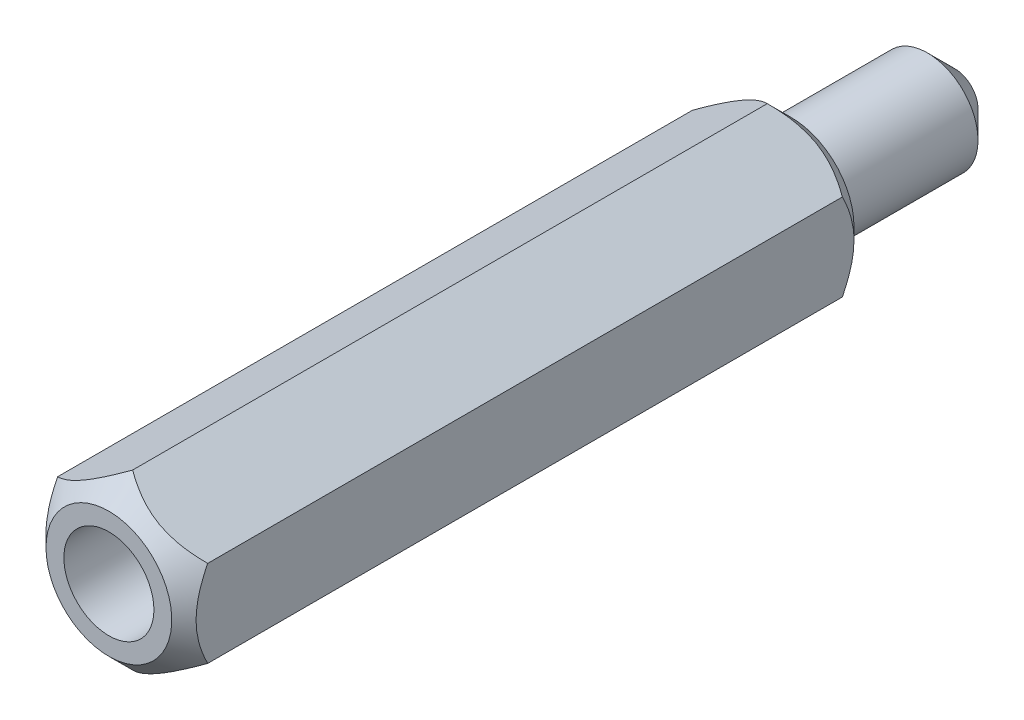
ISO-10303-21;
HEADER;
FILE_DESCRIPTION(('STEP AP214'),'2;1');
FILE_NAME('part.step','',(''),(''),'','','');
FILE_SCHEMA(('AUTOMOTIVE_DESIGN { 1 0 10303 214 1 1 1 1 }'));
ENDSEC;
DATA;
#1=APPLICATION_CONTEXT('core data for automotive mechanical design processes');
#2=APPLICATION_PROTOCOL_DEFINITION('international standard','automotive_design',2000,#1);
#3=PRODUCT_CONTEXT('',#1,'mechanical');
#4=PRODUCT('Part','Part','',(#3));
#5=PRODUCT_RELATED_PRODUCT_CATEGORY('part','',(#4));
#6=PRODUCT_DEFINITION_FORMATION('','',#4);
#7=PRODUCT_DEFINITION_CONTEXT('part definition',#1,'design');
#8=PRODUCT_DEFINITION('design','',#6,#7);
#9=PRODUCT_DEFINITION_SHAPE('','',#8);
#10=(LENGTH_UNIT() NAMED_UNIT(*) SI_UNIT(.MILLI.,.METRE.));
#11=(NAMED_UNIT(*) PLANE_ANGLE_UNIT() SI_UNIT($,.RADIAN.));
#12=(NAMED_UNIT(*) SI_UNIT($,.STERADIAN.) SOLID_ANGLE_UNIT());
#13=UNCERTAINTY_MEASURE_WITH_UNIT(LENGTH_MEASURE(1.E-05),#10,'distance_accuracy_value','');
#14=(GEOMETRIC_REPRESENTATION_CONTEXT(3) GLOBAL_UNCERTAINTY_ASSIGNED_CONTEXT((#13)) GLOBAL_UNIT_ASSIGNED_CONTEXT((#10,
#11,#12)) REPRESENTATION_CONTEXT('',''));
#15=CARTESIAN_POINT('',(0.,0.,0.));
#16=DIRECTION('',(0.,0.,1.));
#17=DIRECTION('',(1.,0.,0.));
#18=AXIS2_PLACEMENT_3D('',#15,#16,#17);
#19=CARTESIAN_POINT('',(0.,0.,-18.5));
#20=DIRECTION('',(0.,0.,-1.));
#21=DIRECTION('',(-1.,0.,0.));
#22=AXIS2_PLACEMENT_3D('',#19,#20,#21);
#23=PLANE('',#22);
#24=CARTESIAN_POINT('',(0.,0.,-18.5000000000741));
#25=DIRECTION('',(0.,0.,1.));
#26=DIRECTION('',(1.,0.,0.));
#27=AXIS2_PLACEMENT_3D('',#24,#25,#26);
#28=CIRCLE('',#27,0.849999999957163);
#29=CARTESIAN_POINT('',(0.849999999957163,0.,-18.5000000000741));
#30=VERTEX_POINT('',#29);
#31=EDGE_CURVE('E17',#30,#30,#28,.T.);
#32=ORIENTED_EDGE('',*,*,#31,.F.);
#33=EDGE_LOOP('',(#32));
#34=FACE_BOUND('',#33,.T.);
#35=ADVANCED_FACE('F14',(#34),#23,.T.);
#36=CARTESIAN_POINT('',(0.,0.,-17.5000000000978));
#37=DIRECTION('',(0.,0.,1.));
#38=DIRECTION('',(1.,0.,0.));
#39=AXIS2_PLACEMENT_3D('',#36,#37,#38);
#40=CONICAL_SURFACE('',#39,1.84999999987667,0.785398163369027);
#41=ORIENTED_EDGE('',*,*,#31,.T.);
#42=EDGE_LOOP('',(#41));
#43=FACE_BOUND('',#42,.T.);
#44=CARTESIAN_POINT('',(0.,0.,-17.5));
#45=DIRECTION('',(0.,0.,1.));
#46=DIRECTION('',(1.,0.,0.));
#47=AXIS2_PLACEMENT_3D('',#44,#45,#46);
#48=CIRCLE('',#47,1.85);
#49=CARTESIAN_POINT('',(1.85,0.,-17.5));
#50=VERTEX_POINT('',#49);
#51=EDGE_CURVE('E107',#50,#50,#48,.T.);
#52=ORIENTED_EDGE('',*,*,#51,.F.);
#53=EDGE_LOOP('',(#52));
#54=FACE_BOUND('',#53,.T.);
#55=ADVANCED_FACE('F208',(#43,#54),#40,.T.);
#56=CARTESIAN_POINT('',(0.,0.,0.400000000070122));
#57=DIRECTION('',(0.,0.,1.));
#58=DIRECTION('',(0.,-1.,0.));
#59=AXIS2_PLACEMENT_3D('',#56,#57,#58);
#60=CONICAL_SURFACE('',#59,1.64999999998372,1.02974425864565);
#61=CARTESIAN_POINT('',(5.6843418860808E-11,0.,-0.59142002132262));
#62=VERTEX_POINT('',#61);
#63=VERTEX_LOOP('',#62);
#64=FACE_BOUND('',#63,.T.);
#65=CARTESIAN_POINT('',(0.,0.,0.400000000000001));
#66=DIRECTION('',(0.,0.,1.));
#67=DIRECTION('',(1.,0.,0.));
#68=AXIS2_PLACEMENT_3D('',#65,#66,#67);
#69=CIRCLE('',#68,1.64999999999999);
#70=CARTESIAN_POINT('',(1.64999999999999,0.,0.400000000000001));
#71=VERTEX_POINT('',#70);
#72=EDGE_CURVE('E89',#71,#71,#69,.T.);
#73=ORIENTED_EDGE('',*,*,#72,.T.);
#74=EDGE_LOOP('',(#73));
#75=FACE_BOUND('',#74,.T.);
#76=ADVANCED_FACE('F205',(#64,#75),#60,.F.);
#77=CARTESIAN_POINT('',(0.,0.,-18.5));
#78=DIRECTION('',(0.,0.,1.));
#79=DIRECTION('',(1.,0.,0.));
#80=AXIS2_PLACEMENT_3D('',#77,#78,#79);
#81=CYLINDRICAL_SURFACE('',#80,1.85);
#82=ORIENTED_EDGE('',*,*,#51,.T.);
#83=EDGE_LOOP('',(#82));
#84=FACE_BOUND('',#83,.T.);
#85=CARTESIAN_POINT('',(0.,0.,-12.5));
#86=DIRECTION('',(0.,0.,1.));
#87=DIRECTION('',(1.,0.,0.));
#88=AXIS2_PLACEMENT_3D('',#85,#86,#87);
#89=CIRCLE('',#88,1.85);
#90=CARTESIAN_POINT('',(1.85,0.,-12.5));
#91=VERTEX_POINT('',#90);
#92=EDGE_CURVE('E243',#91,#91,#89,.F.);
#93=ORIENTED_EDGE('',*,*,#92,.T.);
#94=EDGE_LOOP('',(#93));
#95=FACE_BOUND('',#94,.T.);
#96=ADVANCED_FACE('F201',(#84,#95),#81,.T.);
#97=CARTESIAN_POINT('',(0.,0.,12.5));
#98=DIRECTION('',(0.,0.,1.));
#99=DIRECTION('',(1.,0.,0.));
#100=AXIS2_PLACEMENT_3D('',#97,#98,#99);
#101=CYLINDRICAL_SURFACE('',#100,1.64999999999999);
#102=CARTESIAN_POINT('',(0.,0.,12.5));
#103=DIRECTION('',(0.,0.,1.));
#104=DIRECTION('',(1.,0.,0.));
#105=AXIS2_PLACEMENT_3D('',#102,#103,#104);
#106=CIRCLE('',#105,1.64999999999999);
#107=CARTESIAN_POINT('',(1.64999999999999,0.,12.5));
#108=VERTEX_POINT('',#107);
#109=EDGE_CURVE('E92',#108,#108,#106,.F.);
#110=ORIENTED_EDGE('',*,*,#109,.F.);
#111=EDGE_LOOP('',(#110));
#112=FACE_BOUND('',#111,.T.);
#113=ORIENTED_EDGE('',*,*,#72,.F.);
#114=EDGE_LOOP('',(#113));
#115=FACE_BOUND('',#114,.T.);
#116=ADVANCED_FACE('F197',(#112,#115),#101,.F.);
#117=CARTESIAN_POINT('',(2.74999999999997,1.58771324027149,12.5));
#118=DIRECTION('',(-0.5,-0.866025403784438,0.));
#119=DIRECTION('',(0.866025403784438,-0.5,0.));
#120=AXIS2_PLACEMENT_3D('',#117,#118,#119);
#121=PLANE('',#120);
#122=CARTESIAN_POINT('',(2.7500000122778,1.58771323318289,11.6294013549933));
#123=CARTESIAN_POINT('',(2.65548116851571,1.64228371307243,11.6839194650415));
#124=CARTESIAN_POINT('',(2.55938196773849,1.69776661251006,11.7352351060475));
#125=CARTESIAN_POINT('',(2.36342583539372,1.81090193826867,11.829191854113));
#126=CARTESIAN_POINT('',(2.26355027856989,1.86856511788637,11.8717807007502));
#127=CARTESIAN_POINT('',(2.06215611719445,1.9848400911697,11.9447356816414));
#128=CARTESIAN_POINT('',(1.96068877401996,2.04342228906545,11.9752851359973));
#129=CARTESIAN_POINT('',(1.75552090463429,2.16187601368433,12.0223523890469));
#130=CARTESIAN_POINT('',(1.65182664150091,2.2217439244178,12.0389053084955));
#131=CARTESIAN_POINT('',(1.47310480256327,2.32492902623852,12.0538407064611));
#132=CARTESIAN_POINT('',(1.39830795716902,2.36811300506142,12.0560509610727));
#133=CARTESIAN_POINT('',(1.24883664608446,2.45441030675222,12.0523225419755));
#134=CARTESIAN_POINT('',(1.17416223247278,2.4975235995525,12.0463810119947));
#135=CARTESIAN_POINT('',(1.02551863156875,2.58334302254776,12.0266871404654));
#136=CARTESIAN_POINT('',(0.951550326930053,2.62604864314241,12.0129260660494));
#137=CARTESIAN_POINT('',(0.804892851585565,2.71072137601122,11.9783484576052));
#138=CARTESIAN_POINT('',(0.732203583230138,2.75268854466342,11.9575324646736));
#139=CARTESIAN_POINT('',(0.546058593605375,2.86015940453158,11.895750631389));
#140=CARTESIAN_POINT('',(0.433755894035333,2.92499739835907,11.850132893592));
#141=CARTESIAN_POINT('',(0.268623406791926,3.020336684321,11.7731261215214));
#142=CARTESIAN_POINT('',(0.214204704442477,3.0517553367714,11.7460698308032));
#143=CARTESIAN_POINT('',(0.106374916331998,3.11401089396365,11.6894912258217));
#144=CARTESIAN_POINT('',(0.0529632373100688,3.14484814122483,11.6599704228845));
#145=CARTESIAN_POINT('',(-2.68740248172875E-11,3.17542648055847,11.6294013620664));
#146=B_SPLINE_CURVE_WITH_KNOTS('',3,(#122,#123,#124,#125,#126,#127,#128,#129,#130,#131,#132,
#133,#134,#135,#136,#137,#138,#139,#140,#141,#142,#143,#144,#145),.UNSPECIFIED.,.F.,.F.,(4,2,2,
2,2,2,2,2,2,2,2,4),(0.,0.366253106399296,0.734639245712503,1.09717665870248,1.45880165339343,
1.71762351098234,1.97653607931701,2.23573837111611,2.49492078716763,2.90645502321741,
3.11166392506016,3.31674789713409),.UNSPECIFIED.);
#147=CARTESIAN_POINT('',(2.75000000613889,1.58771320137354,11.6294013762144));
#148=VERTEX_POINT('',#147);
#149=CARTESIAN_POINT('',(0.,3.17542648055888,11.629401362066));
#150=VERTEX_POINT('',#149);
#151=EDGE_CURVE('E88',#148,#150,#146,.T.);
#152=ORIENTED_EDGE('',*,*,#151,.F.);
#153=DIRECTION('',(0.,0.,1.));
#154=VECTOR('',#153,1.);
#155=CARTESIAN_POINT('',(2.74999999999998,1.58771324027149,12.5));
#156=LINE('',#155,#154);
#157=CARTESIAN_POINT('',(2.75000000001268,1.58771324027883,-11.6294013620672));
#158=VERTEX_POINT('',#157);
#159=EDGE_CURVE('E70',#148,#158,#156,.F.);
#160=ORIENTED_EDGE('',*,*,#159,.T.);
#161=CARTESIAN_POINT('',(-3.06724764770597E-11,3.17542648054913,-11.6294013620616));
#162=CARTESIAN_POINT('',(0.0945188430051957,3.12085600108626,-11.6839194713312));
#163=CARTESIAN_POINT('',(0.190618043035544,3.06537310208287,-11.7352351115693));
#164=CARTESIAN_POINT('',(0.386574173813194,2.95223777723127,-11.8291918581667));
#165=CARTESIAN_POINT('',(0.486449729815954,2.89457459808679,-11.8717807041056));
#166=CARTESIAN_POINT('',(0.68784388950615,2.77829962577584,-11.9447356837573));
#167=CARTESIAN_POINT('',(0.789311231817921,2.7197174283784,-11.9752851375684));
#168=CARTESIAN_POINT('',(0.994479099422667,2.6012637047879,-12.0223523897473));
#169=CARTESIAN_POINT('',(1.09817336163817,2.54139579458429,-12.0389053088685));
#170=CARTESIAN_POINT('',(1.27689519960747,2.43821069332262,-12.053840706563));
#171=CARTESIAN_POINT('',(1.35169204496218,2.39502671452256,-12.0560509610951));
#172=CARTESIAN_POINT('',(1.50116335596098,2.30872941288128,-12.052322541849));
#173=CARTESIAN_POINT('',(1.57583776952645,2.26561612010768,-12.0463810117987));
#174=CARTESIAN_POINT('',(1.72448137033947,2.17979669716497,-12.0266871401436));
#175=CARTESIAN_POINT('',(1.7984496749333,2.13709107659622,-12.0129260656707));
#176=CARTESIAN_POINT('',(1.94510715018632,2.05241834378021,-11.9783484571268));
#177=CARTESIAN_POINT('',(2.01779641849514,2.01045117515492,-11.9575324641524));
#178=CARTESIAN_POINT('',(2.20394140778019,1.90298031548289,-11.8957506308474));
#179=CARTESIAN_POINT('',(2.31624410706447,1.8381423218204,-11.8501328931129));
#180=CARTESIAN_POINT('',(2.48137659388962,1.74280303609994,-11.7731261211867));
#181=CARTESIAN_POINT('',(2.53579529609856,1.71138438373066,-11.7460698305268));
#182=CARTESIAN_POINT('',(2.64362508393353,1.64912882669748,-11.689491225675));
#183=CARTESIAN_POINT('',(2.69703676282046,1.61829157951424,-11.6599704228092));
#184=CARTESIAN_POINT('',(2.75000000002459,1.58771324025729,-11.6294013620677));
#185=B_SPLINE_CURVE_WITH_KNOTS('',3,(#161,#162,#163,#164,#165,#166,#167,#168,#169,#170,#171,
#172,#173,#174,#175,#176,#177,#178,#179,#180,#181,#182,#183,#184),.UNSPECIFIED.,.F.,.F.,(4,2,2,
2,2,2,2,2,2,2,2,4),(0.,0.366253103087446,0.734639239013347,1.09717664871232,1.45880164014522,
1.71762349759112,1.97653606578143,2.23573835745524,2.49492077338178,2.90645500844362,
3.11166390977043,3.31674788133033),.UNSPECIFIED.);
#186=CARTESIAN_POINT('',(-1.3795895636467E-11,3.17542648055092,-11.6294013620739));
#187=VERTEX_POINT('',#186);
#188=EDGE_CURVE('E79',#187,#158,#185,.T.);
#189=ORIENTED_EDGE('',*,*,#188,.F.);
#190=DIRECTION('',(0.,0.,1.));
#191=VECTOR('',#190,1.);
#192=CARTESIAN_POINT('',(0.,3.17542648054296,12.5));
#193=LINE('',#192,#191);
#194=EDGE_CURVE('E103',#187,#150,#193,.T.);
#195=ORIENTED_EDGE('',*,*,#194,.T.);
#196=EDGE_LOOP('',(#152,#160,#189,#195));
#197=FACE_BOUND('',#196,.T.);
#198=ADVANCED_FACE('F91',(#197),#121,.F.);
#199=CARTESIAN_POINT('',(0.,0.,-12.5));
#200=DIRECTION('',(0.,0.,1.));
#201=DIRECTION('',(1.,0.,0.));
#202=AXIS2_PLACEMENT_3D('',#199,#200,#201);
#203=PLANE('',#202);
#204=ORIENTED_EDGE('',*,*,#92,.F.);
#205=EDGE_LOOP('',(#204));
#206=FACE_BOUND('',#205,.T.);
#207=CARTESIAN_POINT('',(0.,0.,-12.5000000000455));
#208=DIRECTION('',(0.,0.,1.));
#209=DIRECTION('',(1.,0.,0.));
#210=AXIS2_PLACEMENT_3D('',#207,#208,#209);
#211=CIRCLE('',#210,2.30482784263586);
#212=CARTESIAN_POINT('',(2.30482784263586,0.,-12.5000000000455));
#213=VERTEX_POINT('',#212);
#214=EDGE_CURVE('E76',#213,#213,#211,.T.);
#215=ORIENTED_EDGE('',*,*,#214,.F.);
#216=EDGE_LOOP('',(#215));
#217=FACE_BOUND('',#216,.T.);
#218=ADVANCED_FACE('F196',(#206,#217),#203,.F.);
#219=CARTESIAN_POINT('',(0.,3.17542648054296,12.5));
#220=DIRECTION('',(0.5,-0.866025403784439,0.));
#221=DIRECTION('',(0.866025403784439,0.5,0.));
#222=AXIS2_PLACEMENT_3D('',#219,#220,#221);
#223=PLANE('',#222);
#224=CARTESIAN_POINT('',(3.06443245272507E-11,3.17542648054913,11.6294013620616));
#225=CARTESIAN_POINT('',(-0.0945188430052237,3.12085600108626,11.6839194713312));
#226=CARTESIAN_POINT('',(-0.190618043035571,3.06537310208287,11.7352351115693));
#227=CARTESIAN_POINT('',(-0.386574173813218,2.95223777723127,11.8291918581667));
#228=CARTESIAN_POINT('',(-0.486449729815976,2.89457459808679,11.8717807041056));
#229=CARTESIAN_POINT('',(-0.687843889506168,2.77829962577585,11.9447356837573));
#230=CARTESIAN_POINT('',(-0.789311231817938,2.71971742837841,11.9752851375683));
#231=CARTESIAN_POINT('',(-0.994479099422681,2.60126370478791,12.0223523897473));
#232=CARTESIAN_POINT('',(-1.09817336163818,2.54139579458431,12.0389053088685));
#233=CARTESIAN_POINT('',(-1.27689519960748,2.43821069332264,12.053840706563));
#234=CARTESIAN_POINT('',(-1.35169204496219,2.39502671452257,12.0560509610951));
#235=CARTESIAN_POINT('',(-1.501163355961,2.30872941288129,12.052322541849));
#236=CARTESIAN_POINT('',(-1.57583776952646,2.26561612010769,12.0463810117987));
#237=CARTESIAN_POINT('',(-1.72448137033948,2.17979669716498,12.0266871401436));
#238=CARTESIAN_POINT('',(-1.79844967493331,2.13709107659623,12.0129260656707));
#239=CARTESIAN_POINT('',(-1.94510715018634,2.05241834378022,11.9783484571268));
#240=CARTESIAN_POINT('',(-2.01779641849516,2.01045117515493,11.9575324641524));
#241=CARTESIAN_POINT('',(-2.20394140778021,1.9029803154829,11.8957506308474));
#242=CARTESIAN_POINT('',(-2.31624410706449,1.8381423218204,11.8501328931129));
#243=CARTESIAN_POINT('',(-2.48137659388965,1.74280303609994,11.7731261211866));
#244=CARTESIAN_POINT('',(-2.53579529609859,1.71138438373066,11.7460698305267));
#245=CARTESIAN_POINT('',(-2.64362508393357,1.64912882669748,11.689491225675));
#246=CARTESIAN_POINT('',(-2.69703676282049,1.61829157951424,11.6599704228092));
#247=CARTESIAN_POINT('',(-2.75000000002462,1.58771324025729,11.6294013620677));
#248=B_SPLINE_CURVE_WITH_KNOTS('',3,(#224,#225,#226,#227,#228,#229,#230,#231,#232,#233,#234,
#235,#236,#237,#238,#239,#240,#241,#242,#243,#244,#245,#246,#247),.UNSPECIFIED.,.F.,.F.,(4,2,2,
2,2,2,2,2,2,2,2,4),(0.,0.36625310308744,0.734639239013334,1.0971766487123,1.4588016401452,
1.7176234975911,1.97653606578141,2.23573835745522,2.49492077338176,2.90645500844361,
3.11166390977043,3.31674788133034),.UNSPECIFIED.);
#249=CARTESIAN_POINT('',(-2.75000000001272,1.58771324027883,11.6294013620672));
#250=VERTEX_POINT('',#249);
#251=EDGE_CURVE('E97',#150,#250,#248,.T.);
#252=ORIENTED_EDGE('',*,*,#251,.F.);
#253=ORIENTED_EDGE('',*,*,#194,.F.);
#254=CARTESIAN_POINT('',(-2.75000001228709,1.58771323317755,-11.6294013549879));
#255=CARTESIAN_POINT('',(-2.65548116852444,1.6422837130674,-11.6839194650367));
#256=CARTESIAN_POINT('',(-2.55938196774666,1.69776661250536,-11.7352351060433));
#257=CARTESIAN_POINT('',(-2.3634258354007,1.81090193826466,-11.8291918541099));
#258=CARTESIAN_POINT('',(-2.26355027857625,1.86856511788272,-11.8717807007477));
#259=CARTESIAN_POINT('',(-2.06215611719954,1.98484009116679,-11.9447356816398));
#260=CARTESIAN_POINT('',(-1.96068877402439,2.04342228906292,-11.9752851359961));
#261=CARTESIAN_POINT('',(-1.75552090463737,2.16187601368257,-12.0223523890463));
#262=CARTESIAN_POINT('',(-1.6518266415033,2.22174392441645,-12.0389053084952));
#263=CARTESIAN_POINT('',(-1.47310480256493,2.32492902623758,-12.053840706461));
#264=CARTESIAN_POINT('',(-1.39830795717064,2.3681130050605,-12.0560509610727));
#265=CARTESIAN_POINT('',(-1.24883664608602,2.45441030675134,-12.0523225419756));
#266=CARTESIAN_POINT('',(-1.1741622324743,2.49752359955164,-12.0463810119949));
#267=CARTESIAN_POINT('',(-1.0255186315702,2.58334302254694,-12.0266871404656));
#268=CARTESIAN_POINT('',(-0.951550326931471,2.62604864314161,-12.0129260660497));
#269=CARTESIAN_POINT('',(-0.804892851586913,2.71072137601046,-11.9783484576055));
#270=CARTESIAN_POINT('',(-0.732203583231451,2.75268854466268,-11.957532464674));
#271=CARTESIAN_POINT('',(-0.546058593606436,2.86015940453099,-11.8957506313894));
#272=CARTESIAN_POINT('',(-0.433755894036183,2.92499739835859,-11.8501328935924));
#273=CARTESIAN_POINT('',(-0.268623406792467,3.02033668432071,-11.7731261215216));
#274=CARTESIAN_POINT('',(-0.214204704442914,3.05175533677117,-11.7460698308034));
#275=CARTESIAN_POINT('',(-0.106374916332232,3.11401089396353,-11.6894912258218));
#276=CARTESIAN_POINT('',(-0.0529632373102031,3.14484814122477,-11.6599704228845));
#277=CARTESIAN_POINT('',(2.68385301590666E-11,3.17542648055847,-11.6294013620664));
#278=B_SPLINE_CURVE_WITH_KNOTS('',3,(#254,#255,#256,#257,#258,#259,#260,#261,#262,#263,#264,
#265,#266,#267,#268,#269,#270,#271,#272,#273,#274,#275,#276,#277),.UNSPECIFIED.,.F.,.F.,(4,2,2,
2,2,2,2,2,2,2,2,4),(0.,0.366253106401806,0.734639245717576,1.09717665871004,1.45880165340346,
1.71762351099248,1.97653607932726,2.23573837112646,2.49492078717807,2.90645502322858,
3.11166392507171,3.31674789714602),.UNSPECIFIED.);
#279=CARTESIAN_POINT('',(-2.75000000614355,1.58771320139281,-11.6294013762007));
#280=VERTEX_POINT('',#279);
#281=EDGE_CURVE('E84',#280,#187,#278,.T.);
#282=ORIENTED_EDGE('',*,*,#281,.F.);
#283=DIRECTION('',(0.,0.,-1.));
#284=VECTOR('',#283,1.);
#285=CARTESIAN_POINT('',(-2.75000000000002,1.58771324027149,12.5));
#286=LINE('',#285,#284);
#287=EDGE_CURVE('E101',#280,#250,#286,.F.);
#288=ORIENTED_EDGE('',*,*,#287,.T.);
#289=EDGE_LOOP('',(#252,#253,#282,#288));
#290=FACE_BOUND('',#289,.T.);
#291=ADVANCED_FACE('F242',(#290),#223,.F.);
#292=CARTESIAN_POINT('',(0.,0.,12.5));
#293=DIRECTION('',(0.,0.,1.));
#294=DIRECTION('',(1.,0.,0.));
#295=AXIS2_PLACEMENT_3D('',#292,#293,#294);
#296=PLANE('',#295);
#297=ORIENTED_EDGE('',*,*,#109,.T.);
#298=EDGE_LOOP('',(#297));
#299=FACE_BOUND('',#298,.T.);
#300=CARTESIAN_POINT('',(0.,0.,12.5000000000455));
#301=DIRECTION('',(0.,0.,-1.));
#302=DIRECTION('',(-1.,0.,0.));
#303=AXIS2_PLACEMENT_3D('',#300,#301,#302);
#304=CIRCLE('',#303,2.30482784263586);
#305=CARTESIAN_POINT('',(-2.30482784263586,0.,12.5000000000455));
#306=VERTEX_POINT('',#305);
#307=EDGE_CURVE('E234',#306,#306,#304,.T.);
#308=ORIENTED_EDGE('',*,*,#307,.F.);
#309=EDGE_LOOP('',(#308));
#310=FACE_BOUND('',#309,.T.);
#311=ADVANCED_FACE('F254',(#299,#310),#296,.T.);
#312=CARTESIAN_POINT('',(2.74999999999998,-1.58771324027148,12.5));
#313=DIRECTION('',(-1.,0.,0.));
#314=DIRECTION('',(0.,-1.,0.));
#315=AXIS2_PLACEMENT_3D('',#312,#313,#314);
#316=PLANE('',#315);
#317=ORIENTED_EDGE('',*,*,#159,.F.);
#318=CARTESIAN_POINT('',(2.74999999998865,-1.58771324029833,11.6294013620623));
#319=CARTESIAN_POINT('',(2.7499999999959,-1.47928527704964,11.6835647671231));
#320=CARTESIAN_POINT('',(2.74999999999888,-1.36905594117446,11.7345655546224));
#321=CARTESIAN_POINT('',(2.75000000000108,-1.14424534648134,11.8280510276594));
#322=CARTESIAN_POINT('',(2.75000000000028,-1.02964071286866,11.8704790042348));
#323=CARTESIAN_POINT('',(2.74999999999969,-0.797119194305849,11.9437430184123));
#324=CARTESIAN_POINT('',(2.7499999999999,-0.679215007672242,11.9746182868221));
#325=CARTESIAN_POINT('',(2.75000000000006,-0.440821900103,12.0221520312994));
#326=CARTESIAN_POINT('',(2.74999999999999,-0.320342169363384,12.0388544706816));
#327=CARTESIAN_POINT('',(2.74999999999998,-0.166186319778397,12.0500121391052));
#328=CARTESIAN_POINT('',(2.74999999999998,-0.13296576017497,12.0518160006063));
#329=CARTESIAN_POINT('',(2.74999999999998,-0.0664982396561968,12.0542239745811));
#330=CARTESIAN_POINT('',(2.74999999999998,-0.0332513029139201,12.0548287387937));
#331=CARTESIAN_POINT('',(2.74999999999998,0.083454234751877,12.0548255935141));
#332=CARTESIAN_POINT('',(2.74999999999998,0.166935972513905,12.0510082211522));
#333=CARTESIAN_POINT('',(2.74999999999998,0.333259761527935,12.0359492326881));
#334=CARTESIAN_POINT('',(2.74999999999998,0.41610132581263,12.0247024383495));
#335=CARTESIAN_POINT('',(2.74999999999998,0.580935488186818,11.995312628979));
#336=CARTESIAN_POINT('',(2.74999999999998,0.66292236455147,11.9771378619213));
#337=CARTESIAN_POINT('',(2.74999999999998,0.825318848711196,11.9347233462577));
#338=CARTESIAN_POINT('',(2.74999999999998,0.905727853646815,11.9104813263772));
#339=CARTESIAN_POINT('',(2.74999999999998,1.08909251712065,11.8486374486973));
#340=CARTESIAN_POINT('',(2.74999999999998,1.19143367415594,11.8092165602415));
#341=CARTESIAN_POINT('',(2.74999999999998,1.3422184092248,11.7450883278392));
#342=CARTESIAN_POINT('',(2.74999999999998,1.39180502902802,11.7229916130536));
#343=CARTESIAN_POINT('',(2.74999999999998,1.49027534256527,11.6772850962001));
#344=CARTESIAN_POINT('',(2.74999999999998,1.53915905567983,11.6536753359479));
#345=CARTESIAN_POINT('',(2.74999999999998,1.58771316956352,11.6294013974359));
#346=B_SPLINE_CURVE_WITH_KNOTS('',3,(#318,#319,#320,#321,#322,#323,#324,#325,#326,#327,#328,
#329,#330,#331,#332,#333,#334,#335,#336,#337,#338,#339,#340,#341,#342,#343,#344,#345),
.UNSPECIFIED.,.F.,.F.,(4,2,2,2,2,2,2,2,2,2,2,2,2,4),(0.,0.36386129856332,0.730055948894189,
1.09499553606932,1.45879891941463,1.55859251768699,1.65833186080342,1.90865800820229,
2.1591588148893,2.41082178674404,2.66257910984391,2.99122851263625,3.1540716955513,
3.31691037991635),.UNSPECIFIED.);
#347=CARTESIAN_POINT('',(2.74999999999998,-1.58771324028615,11.6294013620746));
#348=VERTEX_POINT('',#347);
#349=EDGE_CURVE('E168',#348,#148,#346,.T.);
#350=ORIENTED_EDGE('',*,*,#349,.F.);
#351=DIRECTION('',(0.,0.,1.));
#352=VECTOR('',#351,1.);
#353=CARTESIAN_POINT('',(2.74999999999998,-1.58771324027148,12.5));
#354=LINE('',#353,#352);
#355=CARTESIAN_POINT('',(2.75000000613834,-1.58771320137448,-11.6294013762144));
#356=VERTEX_POINT('',#355);
#357=EDGE_CURVE('E71',#348,#356,#354,.F.);
#358=ORIENTED_EDGE('',*,*,#357,.T.);
#359=CARTESIAN_POINT('',(2.74999999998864,1.58771324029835,-11.6294013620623));
#360=CARTESIAN_POINT('',(2.74999999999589,1.47928527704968,-11.6835647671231));
#361=CARTESIAN_POINT('',(2.74999999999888,1.36905594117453,-11.7345655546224));
#362=CARTESIAN_POINT('',(2.75000000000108,1.14424534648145,-11.8280510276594));
#363=CARTESIAN_POINT('',(2.75000000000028,1.02964071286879,-11.8704790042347));
#364=CARTESIAN_POINT('',(2.74999999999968,0.797119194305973,-11.9437430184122));
#365=CARTESIAN_POINT('',(2.74999999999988,0.679215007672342,-11.9746182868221));
#366=CARTESIAN_POINT('',(2.75000000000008,0.440821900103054,-12.0221520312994));
#367=CARTESIAN_POINT('',(2.75000000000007,0.320342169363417,-12.0388544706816));
#368=CARTESIAN_POINT('',(2.74999999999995,0.166186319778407,-12.0500121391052));
#369=CARTESIAN_POINT('',(2.74999999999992,0.132965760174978,-12.0518160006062));
#370=CARTESIAN_POINT('',(2.75000000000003,0.0664982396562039,-12.0542239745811));
#371=CARTESIAN_POINT('',(2.75000000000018,0.0332513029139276,-12.0548287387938));
#372=CARTESIAN_POINT('',(2.75000000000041,-0.0834542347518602,-12.0548255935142));
#373=CARTESIAN_POINT('',(2.7500000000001,-0.16693597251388,-12.0510082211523));
#374=CARTESIAN_POINT('',(2.74999999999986,-0.333259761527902,-12.035949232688));
#375=CARTESIAN_POINT('',(2.74999999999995,-0.416101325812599,-12.0247024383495));
#376=CARTESIAN_POINT('',(2.75000000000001,-0.580935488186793,-11.995312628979));
#377=CARTESIAN_POINT('',(2.74999999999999,-0.662922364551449,-11.9771378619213));
#378=CARTESIAN_POINT('',(2.74999999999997,-0.825318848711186,-11.9347233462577));
#379=CARTESIAN_POINT('',(2.74999999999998,-0.905727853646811,-11.9104813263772));
#380=CARTESIAN_POINT('',(2.74999999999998,-1.08909251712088,-11.8486374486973));
#381=CARTESIAN_POINT('',(2.74999999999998,-1.19143367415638,-11.8092165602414));
#382=CARTESIAN_POINT('',(2.74999999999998,-1.34221840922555,-11.7450883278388));
#383=CARTESIAN_POINT('',(2.74999999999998,-1.39180502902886,-11.7229916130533));
#384=CARTESIAN_POINT('',(2.74999999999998,-1.49027534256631,-11.6772850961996));
#385=CARTESIAN_POINT('',(2.74999999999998,-1.53915905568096,-11.6536753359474));
#386=CARTESIAN_POINT('',(2.74999999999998,-1.58771316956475,-11.6294013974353));
#387=B_SPLINE_CURVE_WITH_KNOTS('',3,(#359,#360,#361,#362,#363,#364,#365,#366,#367,#368,#369,
#370,#371,#372,#373,#374,#375,#376,#377,#378,#379,#380,#381,#382,#383,#384,#385,#386),
.UNSPECIFIED.,.F.,.F.,(4,2,2,2,2,2,2,2,2,2,2,2,2,4),(0.,0.363861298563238,0.730055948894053,
1.09499553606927,1.45879891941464,1.558592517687,1.65833186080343,1.90865800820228,
2.1591588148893,2.41082178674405,2.66257910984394,2.99122851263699,3.15407169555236,
3.31691037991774),.UNSPECIFIED.);
#388=EDGE_CURVE('E66',#158,#356,#387,.T.);
#389=ORIENTED_EDGE('',*,*,#388,.F.);
#390=EDGE_LOOP('',(#317,#350,#358,#389));
#391=FACE_BOUND('',#390,.T.);
#392=ADVANCED_FACE('F68',(#391),#316,.F.);
#393=CARTESIAN_POINT('',(0.,0.,-11.6241777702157));
#394=DIRECTION('',(0.,0.,1.));
#395=DIRECTION('',(1.,0.,0.));
#396=AXIS2_PLACEMENT_3D('',#393,#394,#395);
#397=CONICAL_SURFACE('',#396,3.18065007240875,0.785398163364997);
#398=CARTESIAN_POINT('',(-2.74999999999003,-1.58771324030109,-11.6294013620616));
#399=CARTESIAN_POINT('',(-2.74999999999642,-1.47928527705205,-11.6835647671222));
#400=CARTESIAN_POINT('',(-2.74999999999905,-1.36905594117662,-11.7345655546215));
#401=CARTESIAN_POINT('',(-2.75000000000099,-1.14424534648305,-11.8280510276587));
#402=CARTESIAN_POINT('',(-2.75000000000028,-1.02964071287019,-11.8704790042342));
#403=CARTESIAN_POINT('',(-2.74999999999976,-0.797119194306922,-11.943743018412));
#404=CARTESIAN_POINT('',(-2.74999999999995,-0.679215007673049,-11.9746182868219));
#405=CARTESIAN_POINT('',(-2.75000000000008,-0.440821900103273,-12.0221520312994));
#406=CARTESIAN_POINT('',(-2.75000000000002,-0.320342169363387,-12.0388544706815));
#407=CARTESIAN_POINT('',(-2.75000000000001,-0.166186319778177,-12.0500121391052));
#408=CARTESIAN_POINT('',(-2.75000000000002,-0.132965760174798,-12.0518160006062));
#409=CARTESIAN_POINT('',(-2.75000000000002,-0.0664982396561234,-12.0542239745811));
#410=CARTESIAN_POINT('',(-2.75000000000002,-0.033251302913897,-12.0548287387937));
#411=CARTESIAN_POINT('',(-2.75000000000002,0.0834542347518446,-12.054825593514));
#412=CARTESIAN_POINT('',(-2.75000000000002,0.166935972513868,-12.0510082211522));
#413=CARTESIAN_POINT('',(-2.75000000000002,0.333259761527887,-12.0359492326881));
#414=CARTESIAN_POINT('',(-2.75000000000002,0.416101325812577,-12.0247024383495));
#415=CARTESIAN_POINT('',(-2.75000000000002,0.580935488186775,-11.9953126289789));
#416=CARTESIAN_POINT('',(-2.75000000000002,0.662922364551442,-11.9771378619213));
#417=CARTESIAN_POINT('',(-2.75000000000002,0.825318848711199,-11.9347233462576));
#418=CARTESIAN_POINT('',(-2.75000000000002,0.905727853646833,-11.9104813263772));
#419=CARTESIAN_POINT('',(-2.75000000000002,1.08909251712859,-11.8486374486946));
#420=CARTESIAN_POINT('',(-2.75000000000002,1.19143367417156,-11.8092165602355));
#421=CARTESIAN_POINT('',(-2.75000000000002,1.34221840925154,-11.7450883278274));
#422=CARTESIAN_POINT('',(-2.75000000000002,1.39180502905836,-11.7229916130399));
#423=CARTESIAN_POINT('',(-2.75000000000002,1.49027534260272,-11.6772850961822));
#424=CARTESIAN_POINT('',(-2.75000000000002,1.53915905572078,-11.6536753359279));
#425=CARTESIAN_POINT('',(-2.75000000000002,1.58771316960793,-11.6294013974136));
#426=B_SPLINE_CURVE_WITH_KNOTS('',3,(#398,#399,#400,#401,#402,#403,#404,#405,#406,#407,#408,
#409,#410,#411,#412,#413,#414,#415,#416,#417,#418,#419,#420,#421,#422,#423,#424,#425),
.UNSPECIFIED.,.F.,.F.,(4,2,2,2,2,2,2,2,2,2,2,2,2,4),(0.,0.363861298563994,0.73005594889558,
1.09499553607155,1.45879891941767,1.55859251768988,1.65833186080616,1.90865800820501,
2.15915881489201,2.4108217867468,2.66257910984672,2.99122851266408,3.15407169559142,
3.31691037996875),.UNSPECIFIED.);
#427=CARTESIAN_POINT('',(-2.75000000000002,-1.58771324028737,-11.6294013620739));
#428=VERTEX_POINT('',#427);
#429=EDGE_CURVE('E75',#428,#280,#426,.T.);
#430=ORIENTED_EDGE('',*,*,#429,.T.);
#431=ORIENTED_EDGE('',*,*,#281,.T.);
#432=ORIENTED_EDGE('',*,*,#188,.T.);
#433=ORIENTED_EDGE('',*,*,#388,.T.);
#434=CARTESIAN_POINT('',(2.75000001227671,-1.58771323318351,-11.6294013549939));
#435=CARTESIAN_POINT('',(2.65548116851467,-1.64228371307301,-11.6839194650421));
#436=CARTESIAN_POINT('',(2.55938196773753,-1.6977666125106,-11.735235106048));
#437=CARTESIAN_POINT('',(2.36342583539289,-1.81090193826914,-11.8291918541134));
#438=CARTESIAN_POINT('',(2.26355027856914,-1.8685651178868,-11.8717807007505));
#439=CARTESIAN_POINT('',(2.06215611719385,-1.98484009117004,-11.9447356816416));
#440=CARTESIAN_POINT('',(1.96068877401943,-2.04342228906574,-11.9752851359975));
#441=CARTESIAN_POINT('',(1.75552090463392,-2.16187601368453,-12.022352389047));
#442=CARTESIAN_POINT('',(1.65182664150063,-2.22174392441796,-12.0389053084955));
#443=CARTESIAN_POINT('',(1.47310480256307,-2.32492902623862,-12.0538407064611));
#444=CARTESIAN_POINT('',(1.39830795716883,-2.36811300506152,-12.0560509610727));
#445=CARTESIAN_POINT('',(1.24883664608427,-2.45441030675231,-12.0523225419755));
#446=CARTESIAN_POINT('',(1.1741622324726,-2.49752359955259,-12.0463810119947));
#447=CARTESIAN_POINT('',(1.02551863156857,-2.58334302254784,-12.0266871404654));
#448=CARTESIAN_POINT('',(0.951550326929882,-2.62604864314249,-12.0129260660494));
#449=CARTESIAN_POINT('',(0.804892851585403,-2.7107213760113,-11.9783484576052));
#450=CARTESIAN_POINT('',(0.732203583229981,-2.7526885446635,-11.9575324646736));
#451=CARTESIAN_POINT('',(0.546058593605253,-2.86015940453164,-11.8957506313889));
#452=CARTESIAN_POINT('',(0.433755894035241,-2.9249973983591,-11.850132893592));
#453=CARTESIAN_POINT('',(0.268623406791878,-3.02033668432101,-11.7731261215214));
#454=CARTESIAN_POINT('',(0.214204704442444,-3.05175533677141,-11.7460698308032));
#455=CARTESIAN_POINT('',(0.106374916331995,-3.11401089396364,-11.6894912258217));
#456=CARTESIAN_POINT('',(0.052963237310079,-3.14484814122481,-11.6599704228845));
#457=CARTESIAN_POINT('',(-2.68506650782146E-11,-3.17542648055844,-11.6294013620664));
#458=B_SPLINE_CURVE_WITH_KNOTS('',3,(#434,#435,#436,#437,#438,#439,#440,#441,#442,#443,#444,
#445,#446,#447,#448,#449,#450,#451,#452,#453,#454,#455,#456,#457),.UNSPECIFIED.,.F.,.F.,(4,2,2,
2,2,2,2,2,2,2,2,4),(0.,0.366253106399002,0.734639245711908,1.09717665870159,1.45880165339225,
1.71762351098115,1.9765360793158,2.23573837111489,2.4949207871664,2.90645502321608,
3.11166392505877,3.31674789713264),.UNSPECIFIED.);
#459=CARTESIAN_POINT('',(0.,-3.17542648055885,-11.629401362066));
#460=VERTEX_POINT('',#459);
#461=EDGE_CURVE('E164',#356,#460,#458,.T.);
#462=ORIENTED_EDGE('',*,*,#461,.T.);
#463=CARTESIAN_POINT('',(3.06661937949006E-11,-3.1754264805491,-11.6294013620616));
#464=CARTESIAN_POINT('',(-0.0945188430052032,-3.12085600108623,-11.6839194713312));
#465=CARTESIAN_POINT('',(-0.190618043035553,-3.06537310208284,-11.7352351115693));
#466=CARTESIAN_POINT('',(-0.386574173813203,-2.95223777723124,-11.8291918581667));
#467=CARTESIAN_POINT('',(-0.486449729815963,-2.89457459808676,-11.8717807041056));
#468=CARTESIAN_POINT('',(-0.687843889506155,-2.77829962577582,-11.9447356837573));
#469=CARTESIAN_POINT('',(-0.789311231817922,-2.71971742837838,-11.9752851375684));
#470=CARTESIAN_POINT('',(-0.994479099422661,-2.60126370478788,-12.0223523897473));
#471=CARTESIAN_POINT('',(-1.09817336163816,-2.54139579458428,-12.0389053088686));
#472=CARTESIAN_POINT('',(-1.27689519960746,-2.43821069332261,-12.053840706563));
#473=CARTESIAN_POINT('',(-1.35169204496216,-2.39502671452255,-12.0560509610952));
#474=CARTESIAN_POINT('',(-1.50116335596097,-2.30872941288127,-12.052322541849));
#475=CARTESIAN_POINT('',(-1.57583776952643,-2.26561612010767,-12.0463810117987));
#476=CARTESIAN_POINT('',(-1.72448137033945,-2.17979669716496,-12.0266871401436));
#477=CARTESIAN_POINT('',(-1.79844967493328,-2.13709107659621,-12.0129260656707));
#478=CARTESIAN_POINT('',(-1.9451071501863,-2.05241834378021,-11.9783484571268));
#479=CARTESIAN_POINT('',(-2.01779641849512,-2.01045117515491,-11.9575324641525));
#480=CARTESIAN_POINT('',(-2.20394140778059,-1.90298031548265,-11.8957506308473));
#481=CARTESIAN_POINT('',(-2.31624410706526,-1.83814232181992,-11.8501328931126));
#482=CARTESIAN_POINT('',(-2.481376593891,-1.74280303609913,-11.773126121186));
#483=CARTESIAN_POINT('',(-2.53579529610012,-1.71138438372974,-11.746069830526));
#484=CARTESIAN_POINT('',(-2.64362508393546,-1.64912882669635,-11.689491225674));
#485=CARTESIAN_POINT('',(-2.69703676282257,-1.61829157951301,-11.659970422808));
#486=CARTESIAN_POINT('',(-2.75000000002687,-1.58771324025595,-11.6294013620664));
#487=B_SPLINE_CURVE_WITH_KNOTS('',3,(#463,#464,#465,#466,#467,#468,#469,#470,#471,#472,#473,
#474,#475,#476,#477,#478,#479,#480,#481,#482,#483,#484,#485,#486),.UNSPECIFIED.,.F.,.F.,(4,2,2,
2,2,2,2,2,2,2,2,4),(0.,0.366253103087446,0.734639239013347,1.0971766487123,1.4588016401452,
1.71762349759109,1.9765360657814,2.23573835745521,2.49492077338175,2.90645500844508,
3.11166390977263,3.31674788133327),.UNSPECIFIED.);
#488=EDGE_CURVE('E118',#460,#428,#487,.T.);
#489=ORIENTED_EDGE('',*,*,#488,.T.);
#490=EDGE_LOOP('',(#430,#431,#432,#433,#462,#489));
#491=FACE_BOUND('',#490,.T.);
#492=ORIENTED_EDGE('',*,*,#214,.T.);
#493=EDGE_LOOP('',(#492));
#494=FACE_BOUND('',#493,.T.);
#495=ADVANCED_FACE('F81',(#491,#494),#397,.T.);
#496=CARTESIAN_POINT('',(-2.75000000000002,1.58771324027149,12.5));
#497=DIRECTION('',(1.,0.,0.));
#498=DIRECTION('',(0.,0.,-1.));
#499=AXIS2_PLACEMENT_3D('',#496,#497,#498);
#500=PLANE('',#499);
#501=CARTESIAN_POINT('',(-2.74999999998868,1.58771324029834,11.6294013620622));
#502=CARTESIAN_POINT('',(-2.74999999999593,1.47928527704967,11.683564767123));
#503=CARTESIAN_POINT('',(-2.74999999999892,1.36905594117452,11.7345655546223));
#504=CARTESIAN_POINT('',(-2.75000000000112,1.14424534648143,11.8280510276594));
#505=CARTESIAN_POINT('',(-2.75000000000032,1.02964071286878,11.8704790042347));
#506=CARTESIAN_POINT('',(-2.74999999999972,0.797119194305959,11.9437430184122));
#507=CARTESIAN_POINT('',(-2.74999999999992,0.679215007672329,11.974618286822));
#508=CARTESIAN_POINT('',(-2.75000000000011,0.440821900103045,12.0221520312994));
#509=CARTESIAN_POINT('',(-2.7500000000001,0.32034216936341,12.0388544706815));
#510=CARTESIAN_POINT('',(-2.74999999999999,0.166186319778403,12.0500121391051));
#511=CARTESIAN_POINT('',(-2.74999999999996,0.132965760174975,12.0518160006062));
#512=CARTESIAN_POINT('',(-2.75000000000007,0.0664982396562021,12.0542239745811));
#513=CARTESIAN_POINT('',(-2.75000000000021,0.0332513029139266,12.0548287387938));
#514=CARTESIAN_POINT('',(-2.75000000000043,-0.0834542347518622,12.0548255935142));
#515=CARTESIAN_POINT('',(-2.75000000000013,-0.166935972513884,12.0510082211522));
#516=CARTESIAN_POINT('',(-2.74999999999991,-0.333259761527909,12.035949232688));
#517=CARTESIAN_POINT('',(-2.74999999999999,-0.416101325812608,12.0247024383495));
#518=CARTESIAN_POINT('',(-2.75000000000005,-0.580935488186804,11.9953126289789));
#519=CARTESIAN_POINT('',(-2.75000000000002,-0.66292236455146,11.9771378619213));
#520=CARTESIAN_POINT('',(-2.75000000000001,-0.825318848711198,11.9347233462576));
#521=CARTESIAN_POINT('',(-2.75000000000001,-0.905727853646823,11.9104813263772));
#522=CARTESIAN_POINT('',(-2.75000000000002,-1.08909251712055,11.8486374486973));
#523=CARTESIAN_POINT('',(-2.75000000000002,-1.19143367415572,11.8092165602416));
#524=CARTESIAN_POINT('',(-2.75000000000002,-1.34221840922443,11.7450883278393));
#525=CARTESIAN_POINT('',(-2.75000000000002,-1.39180502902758,11.7229916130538));
#526=CARTESIAN_POINT('',(-2.75000000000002,-1.49027534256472,11.6772850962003));
#527=CARTESIAN_POINT('',(-2.75000000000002,-1.53915905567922,11.6536753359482));
#528=CARTESIAN_POINT('',(-2.75000000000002,-1.58771316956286,11.6294013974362));
#529=B_SPLINE_CURVE_WITH_KNOTS('',3,(#501,#502,#503,#504,#505,#506,#507,#508,#509,#510,#511,
#512,#513,#514,#515,#516,#517,#518,#519,#520,#521,#522,#523,#524,#525,#526,#527,#528),
.UNSPECIFIED.,.F.,.F.,(4,2,2,2,2,2,2,2,2,2,2,2,2,4),(0.,0.363861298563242,0.730055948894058,
1.09499553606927,1.45879891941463,1.55859251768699,1.65833186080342,1.90865800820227,
2.1591588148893,2.41082178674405,2.66257910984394,2.99122851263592,3.15407169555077,
3.31691037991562),.UNSPECIFIED.);
#530=CARTESIAN_POINT('',(-2.7500000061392,-1.58771320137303,11.6294013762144));
#531=VERTEX_POINT('',#530);
#532=EDGE_CURVE('E139',#250,#531,#529,.T.);
#533=ORIENTED_EDGE('',*,*,#532,.F.);
#534=ORIENTED_EDGE('',*,*,#287,.F.);
#535=ORIENTED_EDGE('',*,*,#429,.F.);
#536=DIRECTION('',(0.,0.,1.));
#537=VECTOR('',#536,1.);
#538=CARTESIAN_POINT('',(-2.75000000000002,-1.58771324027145,12.5));
#539=LINE('',#538,#537);
#540=EDGE_CURVE('E117',#428,#531,#539,.T.);
#541=ORIENTED_EDGE('',*,*,#540,.T.);
#542=EDGE_LOOP('',(#533,#534,#535,#541));
#543=FACE_BOUND('',#542,.T.);
#544=ADVANCED_FACE('F132',(#543),#500,.F.);
#545=CARTESIAN_POINT('',(0.,0.,11.6241777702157));
#546=DIRECTION('',(0.,0.,-1.));
#547=DIRECTION('',(-1.,0.,0.));
#548=AXIS2_PLACEMENT_3D('',#545,#546,#547);
#549=CONICAL_SURFACE('',#548,3.18065007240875,0.785398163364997);
#550=ORIENTED_EDGE('',*,*,#307,.T.);
#551=EDGE_LOOP('',(#550));
#552=FACE_BOUND('',#551,.T.);
#553=ORIENTED_EDGE('',*,*,#349,.T.);
#554=ORIENTED_EDGE('',*,*,#151,.T.);
#555=ORIENTED_EDGE('',*,*,#251,.T.);
#556=ORIENTED_EDGE('',*,*,#532,.T.);
#557=CARTESIAN_POINT('',(-2.75000001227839,-1.58771323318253,11.629401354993));
#558=CARTESIAN_POINT('',(-2.65548116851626,-1.64228371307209,11.6839194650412));
#559=CARTESIAN_POINT('',(-2.55938196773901,-1.69776661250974,11.7352351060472));
#560=CARTESIAN_POINT('',(-2.36342583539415,-1.8109019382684,11.8291918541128));
#561=CARTESIAN_POINT('',(-2.26355027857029,-1.86856511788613,11.8717807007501));
#562=CARTESIAN_POINT('',(-2.06215611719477,-1.9848400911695,11.9447356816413));
#563=CARTESIAN_POINT('',(-1.96068877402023,-2.04342228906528,11.9752851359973));
#564=CARTESIAN_POINT('',(-1.75552090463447,-2.1618760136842,12.0223523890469));
#565=CARTESIAN_POINT('',(-1.65182664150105,-2.2217439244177,12.0389053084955));
#566=CARTESIAN_POINT('',(-1.47310480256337,-2.32492902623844,12.0538407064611));
#567=CARTESIAN_POINT('',(-1.39830795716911,-2.36811300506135,12.0560509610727));
#568=CARTESIAN_POINT('',(-1.24883664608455,-2.45441030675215,12.0523225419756));
#569=CARTESIAN_POINT('',(-1.17416223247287,-2.49752359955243,12.0463810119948));
#570=CARTESIAN_POINT('',(-1.02551863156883,-2.58334302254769,12.0266871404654));
#571=CARTESIAN_POINT('',(-0.951550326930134,-2.62604864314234,12.0129260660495));
#572=CARTESIAN_POINT('',(-0.804892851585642,-2.71072137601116,11.9783484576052));
#573=CARTESIAN_POINT('',(-0.732203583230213,-2.75268854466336,11.9575324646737));
#574=CARTESIAN_POINT('',(-0.546058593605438,-2.86015940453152,11.895750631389));
#575=CARTESIAN_POINT('',(-0.433755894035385,-2.92499739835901,11.8501328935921));
#576=CARTESIAN_POINT('',(-0.268623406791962,-3.02033668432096,11.7731261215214));
#577=CARTESIAN_POINT('',(-0.214204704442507,-3.05175533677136,11.7460698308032));
#578=CARTESIAN_POINT('',(-0.106374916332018,-3.11401089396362,11.6894912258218));
#579=CARTESIAN_POINT('',(-0.0529632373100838,-3.1448481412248,11.6599704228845));
#580=CARTESIAN_POINT('',(2.68647047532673E-11,-3.17542648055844,11.6294013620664));
#581=B_SPLINE_CURVE_WITH_KNOTS('',3,(#557,#558,#559,#560,#561,#562,#563,#564,#565,#566,#567,
#568,#569,#570,#571,#572,#573,#574,#575,#576,#577,#578,#579,#580),.UNSPECIFIED.,.F.,.F.,(4,2,2,
2,2,2,2,2,2,2,2,4),(0.,0.366253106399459,0.734639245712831,1.09717665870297,1.45880165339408,
1.71762351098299,1.97653607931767,2.23573837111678,2.4949207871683,2.90645502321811,
3.11166392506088,3.31674789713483),.UNSPECIFIED.);
#582=CARTESIAN_POINT('',(-1.37747665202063E-11,-3.17542648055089,11.6294013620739));
#583=VERTEX_POINT('',#582);
#584=EDGE_CURVE('E23',#531,#583,#581,.T.);
#585=ORIENTED_EDGE('',*,*,#584,.T.);
#586=CARTESIAN_POINT('',(-3.06538960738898E-11,-3.1754264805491,11.6294013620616));
#587=CARTESIAN_POINT('',(0.0945188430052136,-3.12085600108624,11.6839194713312));
#588=CARTESIAN_POINT('',(0.19061804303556,-3.06537310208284,11.7352351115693));
#589=CARTESIAN_POINT('',(0.386574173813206,-2.95223777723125,11.8291918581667));
#590=CARTESIAN_POINT('',(0.486449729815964,-2.89457459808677,11.8717807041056));
#591=CARTESIAN_POINT('',(0.687843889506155,-2.77829962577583,11.9447356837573));
#592=CARTESIAN_POINT('',(0.789311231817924,-2.71971742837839,11.9752851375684));
#593=CARTESIAN_POINT('',(0.994479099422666,-2.60126370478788,12.0223523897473));
#594=CARTESIAN_POINT('',(1.09817336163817,-2.54139579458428,12.0389053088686));
#595=CARTESIAN_POINT('',(1.27689519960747,-2.43821069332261,12.053840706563));
#596=CARTESIAN_POINT('',(1.35169204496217,-2.39502671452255,12.0560509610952));
#597=CARTESIAN_POINT('',(1.50116335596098,-2.30872941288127,12.052322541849));
#598=CARTESIAN_POINT('',(1.57583776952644,-2.26561612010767,12.0463810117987));
#599=CARTESIAN_POINT('',(1.72448137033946,-2.17979669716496,12.0266871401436));
#600=CARTESIAN_POINT('',(1.79844967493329,-2.13709107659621,12.0129260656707));
#601=CARTESIAN_POINT('',(1.94510715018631,-2.0524183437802,11.9783484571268));
#602=CARTESIAN_POINT('',(2.01779641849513,-2.01045117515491,11.9575324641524));
#603=CARTESIAN_POINT('',(2.20394140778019,-1.90298031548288,11.8957506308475));
#604=CARTESIAN_POINT('',(2.31624410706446,-1.83814232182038,11.850132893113));
#605=CARTESIAN_POINT('',(2.48137659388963,-1.74280303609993,11.7731261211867));
#606=CARTESIAN_POINT('',(2.53579529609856,-1.71138438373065,11.7460698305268));
#607=CARTESIAN_POINT('',(2.64362508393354,-1.64912882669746,11.689491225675));
#608=CARTESIAN_POINT('',(2.69703676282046,-1.61829157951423,11.6599704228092));
#609=CARTESIAN_POINT('',(2.75000000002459,-1.58771324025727,11.6294013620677));
#610=B_SPLINE_CURVE_WITH_KNOTS('',3,(#586,#587,#588,#589,#590,#591,#592,#593,#594,#595,#596,
#597,#598,#599,#600,#601,#602,#603,#604,#605,#606,#607,#608,#609),.UNSPECIFIED.,.F.,.F.,(4,2,2,
2,2,2,2,2,2,2,2,4),(0.,0.366253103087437,0.73463923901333,1.09717664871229,1.45880164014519,
1.71762349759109,1.9765360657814,2.23573835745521,2.49492077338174,2.90645500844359,
3.11166390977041,3.31674788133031),.UNSPECIFIED.);
#611=EDGE_CURVE('E31',#583,#348,#610,.T.);
#612=ORIENTED_EDGE('',*,*,#611,.T.);
#613=EDGE_LOOP('',(#553,#554,#555,#556,#585,#612));
#614=FACE_BOUND('',#613,.T.);
#615=ADVANCED_FACE('F127',(#552,#614),#549,.T.);
#616=CARTESIAN_POINT('',(0.,-3.17542648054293,12.5));
#617=DIRECTION('',(-0.5,0.866025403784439,0.));
#618=DIRECTION('',(-0.866025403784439,-0.5,0.));
#619=AXIS2_PLACEMENT_3D('',#616,#617,#618);
#620=PLANE('',#619);
#621=ORIENTED_EDGE('',*,*,#611,.F.);
#622=DIRECTION('',(0.,0.,1.));
#623=VECTOR('',#622,1.);
#624=CARTESIAN_POINT('',(0.,-3.17542648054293,12.5));
#625=LINE('',#624,#623);
#626=EDGE_CURVE('E9',#583,#460,#625,.F.);
#627=ORIENTED_EDGE('',*,*,#626,.T.);
#628=ORIENTED_EDGE('',*,*,#461,.F.);
#629=ORIENTED_EDGE('',*,*,#357,.F.);
#630=EDGE_LOOP('',(#621,#627,#628,#629));
#631=FACE_BOUND('',#630,.T.);
#632=ADVANCED_FACE('F131',(#631),#620,.F.);
#633=CARTESIAN_POINT('',(-2.75000000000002,-1.58771324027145,12.5));
#634=DIRECTION('',(0.499999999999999,0.866025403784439,0.));
#635=DIRECTION('',(-0.866025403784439,0.499999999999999,0.));
#636=AXIS2_PLACEMENT_3D('',#633,#634,#635);
#637=PLANE('',#636);
#638=ORIENTED_EDGE('',*,*,#584,.F.);
#639=ORIENTED_EDGE('',*,*,#540,.F.);
#640=ORIENTED_EDGE('',*,*,#488,.F.);
#641=ORIENTED_EDGE('',*,*,#626,.F.);
#642=EDGE_LOOP('',(#638,#639,#640,#641));
#643=FACE_BOUND('',#642,.T.);
#644=ADVANCED_FACE('F124',(#643),#637,.F.);
#645=CLOSED_SHELL('',(#35,#55,#76,#96,#116,#198,#218,#291,#311,#392,#495,#544,#615,#632,#644));
#646=MANIFOLD_SOLID_BREP('B1',#645);
#647=ADVANCED_BREP_SHAPE_REPRESENTATION('',(#18,#646),#14);
#648=SHAPE_DEFINITION_REPRESENTATION(#9,#647);
ENDSEC;
END-ISO-10303-21;
